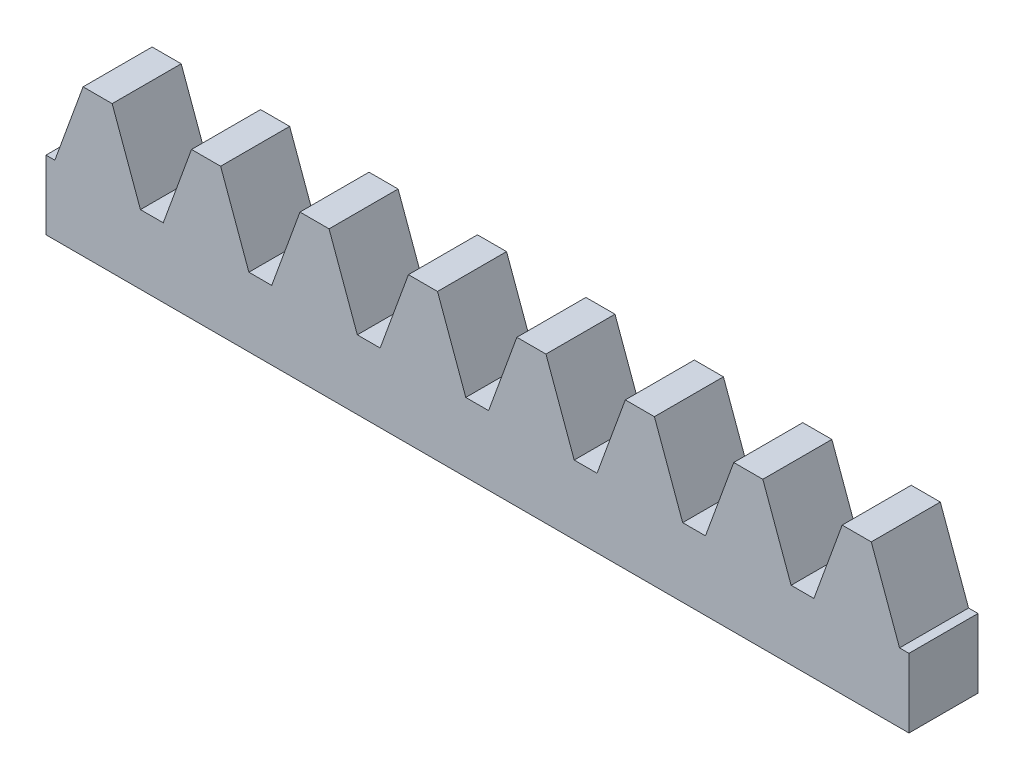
ISO-10303-21;
HEADER;
FILE_DESCRIPTION(('STEP AP214'),'2;1');
FILE_NAME('part.step','',(''),(''),'','','');
FILE_SCHEMA(('AUTOMOTIVE_DESIGN { 1 0 10303 214 1 1 1 1 }'));
ENDSEC;
DATA;
#1=APPLICATION_CONTEXT('core data for automotive mechanical design processes');
#2=APPLICATION_PROTOCOL_DEFINITION('international standard','automotive_design',2000,#1);
#3=PRODUCT_CONTEXT('',#1,'mechanical');
#4=PRODUCT('Part','Part','',(#3));
#5=PRODUCT_RELATED_PRODUCT_CATEGORY('part','',(#4));
#6=PRODUCT_DEFINITION_FORMATION('','',#4);
#7=PRODUCT_DEFINITION_CONTEXT('part definition',#1,'design');
#8=PRODUCT_DEFINITION('design','',#6,#7);
#9=PRODUCT_DEFINITION_SHAPE('','',#8);
#10=(LENGTH_UNIT() NAMED_UNIT(*) SI_UNIT(.MILLI.,.METRE.));
#11=(NAMED_UNIT(*) PLANE_ANGLE_UNIT() SI_UNIT($,.RADIAN.));
#12=(NAMED_UNIT(*) SI_UNIT($,.STERADIAN.) SOLID_ANGLE_UNIT());
#13=UNCERTAINTY_MEASURE_WITH_UNIT(LENGTH_MEASURE(1.E-05),#10,'distance_accuracy_value','');
#14=(GEOMETRIC_REPRESENTATION_CONTEXT(3) GLOBAL_UNCERTAINTY_ASSIGNED_CONTEXT((#13)) GLOBAL_UNIT_ASSIGNED_CONTEXT((#10,
#11,#12)) REPRESENTATION_CONTEXT('',''));
#15=CARTESIAN_POINT('',(0.,0.,0.));
#16=DIRECTION('',(0.,0.,1.));
#17=DIRECTION('',(1.,0.,0.));
#18=AXIS2_PLACEMENT_3D('',#15,#16,#17);
#19=CARTESIAN_POINT('',(0.,0.,50.));
#20=DIRECTION('',(-1.,0.,0.));
#21=DIRECTION('',(0.,0.,1.));
#22=AXIS2_PLACEMENT_3D('',#19,#20,#21);
#23=PLANE('',#22);
#24=DIRECTION('',(0.,-1.,0.));
#25=VECTOR('',#24,1.);
#26=CARTESIAN_POINT('',(0.,100.,-30.));
#27=LINE('',#26,#25);
#28=CARTESIAN_POINT('',(0.,77.5,-30.));
#29=VERTEX_POINT('',#28);
#30=CARTESIAN_POINT('',(0.,57.5,-30.));
#31=VERTEX_POINT('',#30);
#32=EDGE_CURVE('E65',#29,#31,#27,.T.);
#33=ORIENTED_EDGE('',*,*,#32,.F.);
#34=DIRECTION('',(0.,0.,-1.));
#35=VECTOR('',#34,1.);
#36=CARTESIAN_POINT('',(0.,77.5,50.));
#37=LINE('',#36,#35);
#38=CARTESIAN_POINT('',(0.,77.5,-50.));
#39=VERTEX_POINT('',#38);
#40=EDGE_CURVE('E466',#29,#39,#37,.T.);
#41=ORIENTED_EDGE('',*,*,#40,.T.);
#42=DIRECTION('',(0.,1.,0.));
#43=VECTOR('',#42,1.);
#44=CARTESIAN_POINT('',(0.,0.,-50.));
#45=LINE('',#44,#43);
#46=CARTESIAN_POINT('',(0.,57.5,-50.));
#47=VERTEX_POINT('',#46);
#48=EDGE_CURVE('E452',#47,#39,#45,.T.);
#49=ORIENTED_EDGE('',*,*,#48,.F.);
#50=DIRECTION('',(0.,0.,1.));
#51=VECTOR('',#50,1.);
#52=CARTESIAN_POINT('',(0.,57.5,-50.));
#53=LINE('',#52,#51);
#54=EDGE_CURVE('E297',#47,#31,#53,.T.);
#55=ORIENTED_EDGE('',*,*,#54,.T.);
#56=EDGE_LOOP('',(#33,#41,#49,#55));
#57=FACE_BOUND('',#56,.T.);
#58=ADVANCED_FACE('F51',(#57),#23,.T.);
#59=CARTESIAN_POINT('',(230.654977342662,100.,50.));
#60=DIRECTION('',(0.939692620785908,-0.342020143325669,0.));
#61=DIRECTION('',(0.342020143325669,0.939692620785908,0.));
#62=AXIS2_PLACEMENT_3D('',#59,#60,#61);
#63=PLANE('',#62);
#64=DIRECTION('',(0.,0.,-1.));
#65=VECTOR('',#64,1.);
#66=CARTESIAN_POINT('',(222.465647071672,77.5,50.));
#67=LINE('',#66,#65);
#68=CARTESIAN_POINT('',(222.465647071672,77.5,-30.));
#69=VERTEX_POINT('',#68);
#70=CARTESIAN_POINT('',(222.465647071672,77.5,-50.));
#71=VERTEX_POINT('',#70);
#72=EDGE_CURVE('E317',#69,#71,#67,.T.);
#73=ORIENTED_EDGE('',*,*,#72,.F.);
#74=DIRECTION('',(0.342020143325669,0.939692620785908,0.));
#75=VECTOR('',#74,1.);
#76=CARTESIAN_POINT('',(230.654977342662,100.,-30.));
#77=LINE('',#76,#75);
#78=CARTESIAN_POINT('',(230.654977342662,100.,-30.));
#79=VERTEX_POINT('',#78);
#80=EDGE_CURVE('E480',#69,#79,#77,.T.);
#81=ORIENTED_EDGE('',*,*,#80,.T.);
#82=DIRECTION('',(0.,0.,-1.));
#83=VECTOR('',#82,1.);
#84=CARTESIAN_POINT('',(230.654977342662,100.,50.));
#85=LINE('',#84,#83);
#86=CARTESIAN_POINT('',(230.654977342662,100.,-50.));
#87=VERTEX_POINT('',#86);
#88=EDGE_CURVE('E308',#79,#87,#85,.T.);
#89=ORIENTED_EDGE('',*,*,#88,.T.);
#90=DIRECTION('',(-0.342020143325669,-0.939692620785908,0.));
#91=VECTOR('',#90,1.);
#92=CARTESIAN_POINT('',(230.654977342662,100.,-50.));
#93=LINE('',#92,#91);
#94=EDGE_CURVE('E376',#87,#71,#93,.T.);
#95=ORIENTED_EDGE('',*,*,#94,.T.);
#96=EDGE_LOOP('',(#73,#81,#89,#95));
#97=FACE_BOUND('',#96,.T.);
#98=ADVANCED_FACE('F667',(#97),#63,.F.);
#99=CARTESIAN_POINT('',(239.083522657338,100.,50.));
#100=DIRECTION('',(0.,-1.,0.));
#101=DIRECTION('',(0.,0.,-1.));
#102=AXIS2_PLACEMENT_3D('',#99,#100,#101);
#103=PLANE('',#102);
#104=ORIENTED_EDGE('',*,*,#88,.F.);
#105=DIRECTION('',(1.,0.,0.));
#106=VECTOR('',#105,1.);
#107=CARTESIAN_POINT('',(0.,100.,-30.));
#108=LINE('',#107,#106);
#109=CARTESIAN_POINT('',(239.083522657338,100.,-30.));
#110=VERTEX_POINT('',#109);
#111=EDGE_CURVE('E286',#79,#110,#108,.T.);
#112=ORIENTED_EDGE('',*,*,#111,.T.);
#113=DIRECTION('',(0.,0.,-1.));
#114=VECTOR('',#113,1.);
#115=CARTESIAN_POINT('',(239.083522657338,100.,50.));
#116=LINE('',#115,#114);
#117=CARTESIAN_POINT('',(239.083522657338,100.,-50.));
#118=VERTEX_POINT('',#117);
#119=EDGE_CURVE('E309',#110,#118,#116,.T.);
#120=ORIENTED_EDGE('',*,*,#119,.T.);
#121=DIRECTION('',(-1.,0.,0.));
#122=VECTOR('',#121,1.);
#123=CARTESIAN_POINT('',(239.083522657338,100.,-50.));
#124=LINE('',#123,#122);
#125=EDGE_CURVE('E373',#118,#87,#124,.T.);
#126=ORIENTED_EDGE('',*,*,#125,.T.);
#127=EDGE_LOOP('',(#104,#112,#120,#126));
#128=FACE_BOUND('',#127,.T.);
#129=ADVANCED_FACE('F672',(#128),#103,.F.);
#130=CARTESIAN_POINT('',(247.272852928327,77.5,50.));
#131=DIRECTION('',(-0.939692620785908,-0.342020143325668,0.));
#132=DIRECTION('',(0.342020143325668,-0.939692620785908,0.));
#133=AXIS2_PLACEMENT_3D('',#130,#131,#132);
#134=PLANE('',#133);
#135=ORIENTED_EDGE('',*,*,#119,.F.);
#136=DIRECTION('',(0.342020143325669,-0.939692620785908,0.));
#137=VECTOR('',#136,1.);
#138=CARTESIAN_POINT('',(247.272852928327,77.5,-30.));
#139=LINE('',#138,#137);
#140=CARTESIAN_POINT('',(247.272852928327,77.5,-30.));
#141=VERTEX_POINT('',#140);
#142=EDGE_CURVE('E301',#110,#141,#139,.T.);
#143=ORIENTED_EDGE('',*,*,#142,.T.);
#144=DIRECTION('',(0.,0.,-1.));
#145=VECTOR('',#144,1.);
#146=CARTESIAN_POINT('',(247.272852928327,77.5,50.));
#147=LINE('',#146,#145);
#148=CARTESIAN_POINT('',(247.272852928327,77.5,-50.));
#149=VERTEX_POINT('',#148);
#150=EDGE_CURVE('E312',#141,#149,#147,.T.);
#151=ORIENTED_EDGE('',*,*,#150,.T.);
#152=DIRECTION('',(-0.342020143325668,0.939692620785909,0.));
#153=VECTOR('',#152,1.);
#154=CARTESIAN_POINT('',(247.272852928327,77.5,-50.));
#155=LINE('',#154,#153);
#156=EDGE_CURVE('E370',#149,#118,#155,.T.);
#157=ORIENTED_EDGE('',*,*,#156,.T.);
#158=EDGE_LOOP('',(#135,#143,#151,#157));
#159=FACE_BOUND('',#158,.T.);
#160=ADVANCED_FACE('F678',(#159),#134,.F.);
#161=CARTESIAN_POINT('',(250.5772,77.5,50.));
#162=DIRECTION('',(0.,-1.,0.));
#163=DIRECTION('',(0.,0.,-1.));
#164=AXIS2_PLACEMENT_3D('',#161,#162,#163);
#165=PLANE('',#164);
#166=ORIENTED_EDGE('',*,*,#150,.F.);
#167=DIRECTION('',(1.,0.,0.));
#168=VECTOR('',#167,1.);
#169=CARTESIAN_POINT('',(250.5772,77.5,-30.));
#170=LINE('',#169,#168);
#171=CARTESIAN_POINT('',(250.,77.5,-30.));
#172=VERTEX_POINT('',#171);
#173=EDGE_CURVE('E478',#141,#172,#170,.T.);
#174=ORIENTED_EDGE('',*,*,#173,.T.);
#175=DIRECTION('',(0.,0.,-1.));
#176=VECTOR('',#175,1.);
#177=CARTESIAN_POINT('',(250.,77.5,50.));
#178=LINE('',#177,#176);
#179=CARTESIAN_POINT('',(250.,77.5,-50.));
#180=VERTEX_POINT('',#179);
#181=EDGE_CURVE('E290',#172,#180,#178,.T.);
#182=ORIENTED_EDGE('',*,*,#181,.T.);
#183=DIRECTION('',(-1.,0.,0.));
#184=VECTOR('',#183,1.);
#185=CARTESIAN_POINT('',(250.5772,77.5,-50.));
#186=LINE('',#185,#184);
#187=EDGE_CURVE('E307',#180,#149,#186,.T.);
#188=ORIENTED_EDGE('',*,*,#187,.T.);
#189=EDGE_LOOP('',(#166,#174,#182,#188));
#190=FACE_BOUND('',#189,.T.);
#191=ADVANCED_FACE('F706',(#190),#165,.F.);
#192=CARTESIAN_POINT('',(199.239077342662,100.,50.));
#193=DIRECTION('',(0.939692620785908,-0.342020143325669,0.));
#194=DIRECTION('',(0.342020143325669,0.939692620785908,0.));
#195=AXIS2_PLACEMENT_3D('',#192,#193,#194);
#196=PLANE('',#195);
#197=DIRECTION('',(0.,0.,-1.));
#198=VECTOR('',#197,1.);
#199=CARTESIAN_POINT('',(191.049747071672,77.5,50.));
#200=LINE('',#199,#198);
#201=CARTESIAN_POINT('',(191.049747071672,77.5,-30.));
#202=VERTEX_POINT('',#201);
#203=CARTESIAN_POINT('',(191.049747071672,77.5,-50.));
#204=VERTEX_POINT('',#203);
#205=EDGE_CURVE('E325',#202,#204,#200,.T.);
#206=ORIENTED_EDGE('',*,*,#205,.F.);
#207=DIRECTION('',(0.342020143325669,0.939692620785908,0.));
#208=VECTOR('',#207,1.);
#209=CARTESIAN_POINT('',(199.239077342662,100.,-30.));
#210=LINE('',#209,#208);
#211=CARTESIAN_POINT('',(199.239077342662,100.,-30.));
#212=VERTEX_POINT('',#211);
#213=EDGE_CURVE('E489',#202,#212,#210,.T.);
#214=ORIENTED_EDGE('',*,*,#213,.T.);
#215=DIRECTION('',(0.,0.,-1.));
#216=VECTOR('',#215,1.);
#217=CARTESIAN_POINT('',(199.239077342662,100.,50.));
#218=LINE('',#217,#216);
#219=CARTESIAN_POINT('',(199.239077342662,100.,-50.));
#220=VERTEX_POINT('',#219);
#221=EDGE_CURVE('E314',#212,#220,#218,.T.);
#222=ORIENTED_EDGE('',*,*,#221,.T.);
#223=DIRECTION('',(-0.342020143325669,-0.939692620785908,0.));
#224=VECTOR('',#223,1.);
#225=CARTESIAN_POINT('',(199.239077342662,100.,-50.));
#226=LINE('',#225,#224);
#227=EDGE_CURVE('E388',#220,#204,#226,.T.);
#228=ORIENTED_EDGE('',*,*,#227,.T.);
#229=EDGE_LOOP('',(#206,#214,#222,#228));
#230=FACE_BOUND('',#229,.T.);
#231=ADVANCED_FACE('F690',(#230),#196,.F.);
#232=CARTESIAN_POINT('',(207.667622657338,100.,50.));
#233=DIRECTION('',(0.,-1.,0.));
#234=DIRECTION('',(0.,0.,-1.));
#235=AXIS2_PLACEMENT_3D('',#232,#233,#234);
#236=PLANE('',#235);
#237=ORIENTED_EDGE('',*,*,#221,.F.);
#238=CARTESIAN_POINT('',(207.667622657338,100.,-30.));
#239=VERTEX_POINT('',#238);
#240=EDGE_CURVE('E551',#212,#239,#108,.T.);
#241=ORIENTED_EDGE('',*,*,#240,.T.);
#242=DIRECTION('',(0.,0.,-1.));
#243=VECTOR('',#242,1.);
#244=CARTESIAN_POINT('',(207.667622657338,100.,50.));
#245=LINE('',#244,#243);
#246=CARTESIAN_POINT('',(207.667622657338,100.,-50.));
#247=VERTEX_POINT('',#246);
#248=EDGE_CURVE('E315',#239,#247,#245,.T.);
#249=ORIENTED_EDGE('',*,*,#248,.T.);
#250=DIRECTION('',(-1.,0.,0.));
#251=VECTOR('',#250,1.);
#252=CARTESIAN_POINT('',(207.667622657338,100.,-50.));
#253=LINE('',#252,#251);
#254=EDGE_CURVE('E385',#247,#220,#253,.T.);
#255=ORIENTED_EDGE('',*,*,#254,.T.);
#256=EDGE_LOOP('',(#237,#241,#249,#255));
#257=FACE_BOUND('',#256,.T.);
#258=ADVANCED_FACE('F686',(#257),#236,.F.);
#259=CARTESIAN_POINT('',(215.856952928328,77.5,50.));
#260=DIRECTION('',(-0.939692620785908,-0.342020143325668,0.));
#261=DIRECTION('',(0.342020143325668,-0.939692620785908,0.));
#262=AXIS2_PLACEMENT_3D('',#259,#260,#261);
#263=PLANE('',#262);
#264=ORIENTED_EDGE('',*,*,#248,.F.);
#265=DIRECTION('',(0.342020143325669,-0.939692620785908,0.));
#266=VECTOR('',#265,1.);
#267=CARTESIAN_POINT('',(215.856952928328,77.5,-30.));
#268=LINE('',#267,#266);
#269=CARTESIAN_POINT('',(215.856952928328,77.5,-30.));
#270=VERTEX_POINT('',#269);
#271=EDGE_CURVE('E483',#239,#270,#268,.T.);
#272=ORIENTED_EDGE('',*,*,#271,.T.);
#273=DIRECTION('',(0.,0.,-1.));
#274=VECTOR('',#273,1.);
#275=CARTESIAN_POINT('',(215.856952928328,77.5,50.));
#276=LINE('',#275,#274);
#277=CARTESIAN_POINT('',(215.856952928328,77.5,-50.));
#278=VERTEX_POINT('',#277);
#279=EDGE_CURVE('E319',#270,#278,#276,.T.);
#280=ORIENTED_EDGE('',*,*,#279,.T.);
#281=DIRECTION('',(-0.342020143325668,0.939692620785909,0.));
#282=VECTOR('',#281,1.);
#283=CARTESIAN_POINT('',(215.856952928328,77.5,-50.));
#284=LINE('',#283,#282);
#285=EDGE_CURVE('E382',#278,#247,#284,.T.);
#286=ORIENTED_EDGE('',*,*,#285,.T.);
#287=EDGE_LOOP('',(#264,#272,#280,#286));
#288=FACE_BOUND('',#287,.T.);
#289=ADVANCED_FACE('F689',(#288),#263,.F.);
#290=CARTESIAN_POINT('',(219.1613,77.5,50.));
#291=DIRECTION('',(0.,-1.,0.));
#292=DIRECTION('',(0.,0.,-1.));
#293=AXIS2_PLACEMENT_3D('',#290,#291,#292);
#294=PLANE('',#293);
#295=ORIENTED_EDGE('',*,*,#279,.F.);
#296=DIRECTION('',(1.,0.,0.));
#297=VECTOR('',#296,1.);
#298=CARTESIAN_POINT('',(219.1613,77.5,-30.));
#299=LINE('',#298,#297);
#300=EDGE_CURVE('E486',#270,#69,#299,.T.);
#301=ORIENTED_EDGE('',*,*,#300,.T.);
#302=ORIENTED_EDGE('',*,*,#72,.T.);
#303=DIRECTION('',(-1.,0.,0.));
#304=VECTOR('',#303,1.);
#305=CARTESIAN_POINT('',(219.1613,77.5,-50.));
#306=LINE('',#305,#304);
#307=EDGE_CURVE('E379',#71,#278,#306,.T.);
#308=ORIENTED_EDGE('',*,*,#307,.T.);
#309=EDGE_LOOP('',(#295,#301,#302,#308));
#310=FACE_BOUND('',#309,.T.);
#311=ADVANCED_FACE('F696',(#310),#294,.F.);
#312=CARTESIAN_POINT('',(167.823177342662,100.,50.));
#313=DIRECTION('',(0.939692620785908,-0.342020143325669,0.));
#314=DIRECTION('',(0.342020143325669,0.939692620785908,0.));
#315=AXIS2_PLACEMENT_3D('',#312,#313,#314);
#316=PLANE('',#315);
#317=DIRECTION('',(0.,0.,-1.));
#318=VECTOR('',#317,1.);
#319=CARTESIAN_POINT('',(159.633847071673,77.5,50.));
#320=LINE('',#319,#318);
#321=CARTESIAN_POINT('',(159.633847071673,77.5,-30.));
#322=VERTEX_POINT('',#321);
#323=CARTESIAN_POINT('',(159.633847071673,77.5,-50.));
#324=VERTEX_POINT('',#323);
#325=EDGE_CURVE('E330',#322,#324,#320,.T.);
#326=ORIENTED_EDGE('',*,*,#325,.F.);
#327=DIRECTION('',(0.342020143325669,0.939692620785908,0.));
#328=VECTOR('',#327,1.);
#329=CARTESIAN_POINT('',(167.823177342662,100.,-30.));
#330=LINE('',#329,#328);
#331=CARTESIAN_POINT('',(167.823177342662,100.,-30.));
#332=VERTEX_POINT('',#331);
#333=EDGE_CURVE('E498',#322,#332,#330,.T.);
#334=ORIENTED_EDGE('',*,*,#333,.T.);
#335=DIRECTION('',(0.,0.,-1.));
#336=VECTOR('',#335,1.);
#337=CARTESIAN_POINT('',(167.823177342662,100.,50.));
#338=LINE('',#337,#336);
#339=CARTESIAN_POINT('',(167.823177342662,100.,-50.));
#340=VERTEX_POINT('',#339);
#341=EDGE_CURVE('E321',#332,#340,#338,.T.);
#342=ORIENTED_EDGE('',*,*,#341,.T.);
#343=DIRECTION('',(-0.342020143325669,-0.939692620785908,0.));
#344=VECTOR('',#343,1.);
#345=CARTESIAN_POINT('',(167.823177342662,100.,-50.));
#346=LINE('',#345,#344);
#347=EDGE_CURVE('E398',#340,#324,#346,.T.);
#348=ORIENTED_EDGE('',*,*,#347,.T.);
#349=EDGE_LOOP('',(#326,#334,#342,#348));
#350=FACE_BOUND('',#349,.T.);
#351=ADVANCED_FACE('F597',(#350),#316,.F.);
#352=CARTESIAN_POINT('',(176.251722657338,100.,50.));
#353=DIRECTION('',(0.,-1.,0.));
#354=DIRECTION('',(0.,0.,-1.));
#355=AXIS2_PLACEMENT_3D('',#352,#353,#354);
#356=PLANE('',#355);
#357=ORIENTED_EDGE('',*,*,#341,.F.);
#358=CARTESIAN_POINT('',(176.251722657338,100.,-30.));
#359=VERTEX_POINT('',#358);
#360=EDGE_CURVE('E556',#332,#359,#108,.T.);
#361=ORIENTED_EDGE('',*,*,#360,.T.);
#362=DIRECTION('',(0.,0.,-1.));
#363=VECTOR('',#362,1.);
#364=CARTESIAN_POINT('',(176.251722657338,100.,50.));
#365=LINE('',#364,#363);
#366=CARTESIAN_POINT('',(176.251722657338,100.,-50.));
#367=VERTEX_POINT('',#366);
#368=EDGE_CURVE('E323',#359,#367,#365,.T.);
#369=ORIENTED_EDGE('',*,*,#368,.T.);
#370=DIRECTION('',(-1.,0.,0.));
#371=VECTOR('',#370,1.);
#372=CARTESIAN_POINT('',(176.251722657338,100.,-50.));
#373=LINE('',#372,#371);
#374=EDGE_CURVE('E395',#367,#340,#373,.T.);
#375=ORIENTED_EDGE('',*,*,#374,.T.);
#376=EDGE_LOOP('',(#357,#361,#369,#375));
#377=FACE_BOUND('',#376,.T.);
#378=ADVANCED_FACE('F585',(#377),#356,.F.);
#379=CARTESIAN_POINT('',(184.441052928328,77.5,50.));
#380=DIRECTION('',(-0.939692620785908,-0.342020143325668,0.));
#381=DIRECTION('',(0.342020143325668,-0.939692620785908,0.));
#382=AXIS2_PLACEMENT_3D('',#379,#380,#381);
#383=PLANE('',#382);
#384=ORIENTED_EDGE('',*,*,#368,.F.);
#385=DIRECTION('',(0.342020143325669,-0.939692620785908,0.));
#386=VECTOR('',#385,1.);
#387=CARTESIAN_POINT('',(184.441052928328,77.5,-30.));
#388=LINE('',#387,#386);
#389=CARTESIAN_POINT('',(184.441052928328,77.5,-30.));
#390=VERTEX_POINT('',#389);
#391=EDGE_CURVE('E492',#359,#390,#388,.T.);
#392=ORIENTED_EDGE('',*,*,#391,.T.);
#393=DIRECTION('',(0.,0.,-1.));
#394=VECTOR('',#393,1.);
#395=CARTESIAN_POINT('',(184.441052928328,77.5,50.));
#396=LINE('',#395,#394);
#397=CARTESIAN_POINT('',(184.441052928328,77.5,-50.));
#398=VERTEX_POINT('',#397);
#399=EDGE_CURVE('E327',#390,#398,#396,.T.);
#400=ORIENTED_EDGE('',*,*,#399,.T.);
#401=DIRECTION('',(-0.342020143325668,0.939692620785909,0.));
#402=VECTOR('',#401,1.);
#403=CARTESIAN_POINT('',(184.441052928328,77.5,-50.));
#404=LINE('',#403,#402);
#405=EDGE_CURVE('E394',#398,#367,#404,.T.);
#406=ORIENTED_EDGE('',*,*,#405,.T.);
#407=EDGE_LOOP('',(#384,#392,#400,#406));
#408=FACE_BOUND('',#407,.T.);
#409=ADVANCED_FACE('F587',(#408),#383,.F.);
#410=CARTESIAN_POINT('',(187.7454,77.5,50.));
#411=DIRECTION('',(0.,-1.,0.));
#412=DIRECTION('',(0.,0.,-1.));
#413=AXIS2_PLACEMENT_3D('',#410,#411,#412);
#414=PLANE('',#413);
#415=ORIENTED_EDGE('',*,*,#399,.F.);
#416=DIRECTION('',(1.,0.,0.));
#417=VECTOR('',#416,1.);
#418=CARTESIAN_POINT('',(187.7454,77.5,-30.));
#419=LINE('',#418,#417);
#420=EDGE_CURVE('E495',#390,#202,#419,.T.);
#421=ORIENTED_EDGE('',*,*,#420,.T.);
#422=ORIENTED_EDGE('',*,*,#205,.T.);
#423=DIRECTION('',(-1.,0.,0.));
#424=VECTOR('',#423,1.);
#425=CARTESIAN_POINT('',(187.7454,77.5,-50.));
#426=LINE('',#425,#424);
#427=EDGE_CURVE('E391',#204,#398,#426,.T.);
#428=ORIENTED_EDGE('',*,*,#427,.T.);
#429=EDGE_LOOP('',(#415,#421,#422,#428));
#430=FACE_BOUND('',#429,.T.);
#431=ADVANCED_FACE('F734',(#430),#414,.F.);
#432=CARTESIAN_POINT('',(136.407277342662,100.,50.));
#433=DIRECTION('',(0.939692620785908,-0.342020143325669,0.));
#434=DIRECTION('',(0.342020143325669,0.939692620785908,0.));
#435=AXIS2_PLACEMENT_3D('',#432,#433,#434);
#436=PLANE('',#435);
#437=DIRECTION('',(0.,0.,-1.));
#438=VECTOR('',#437,1.);
#439=CARTESIAN_POINT('',(128.217947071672,77.5,50.));
#440=LINE('',#439,#438);
#441=CARTESIAN_POINT('',(128.217947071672,77.5,-30.));
#442=VERTEX_POINT('',#441);
#443=CARTESIAN_POINT('',(128.217947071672,77.5,-50.));
#444=VERTEX_POINT('',#443);
#445=EDGE_CURVE('E338',#442,#444,#440,.T.);
#446=ORIENTED_EDGE('',*,*,#445,.F.);
#447=DIRECTION('',(0.342020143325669,0.939692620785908,0.));
#448=VECTOR('',#447,1.);
#449=CARTESIAN_POINT('',(136.407277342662,100.,-30.));
#450=LINE('',#449,#448);
#451=CARTESIAN_POINT('',(136.407277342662,100.,-30.));
#452=VERTEX_POINT('',#451);
#453=EDGE_CURVE('E507',#442,#452,#450,.T.);
#454=ORIENTED_EDGE('',*,*,#453,.T.);
#455=DIRECTION('',(0.,0.,-1.));
#456=VECTOR('',#455,1.);
#457=CARTESIAN_POINT('',(136.407277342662,100.,50.));
#458=LINE('',#457,#456);
#459=CARTESIAN_POINT('',(136.407277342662,100.,-50.));
#460=VERTEX_POINT('',#459);
#461=EDGE_CURVE('E329',#452,#460,#458,.T.);
#462=ORIENTED_EDGE('',*,*,#461,.T.);
#463=DIRECTION('',(-0.342020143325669,-0.939692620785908,0.));
#464=VECTOR('',#463,1.);
#465=CARTESIAN_POINT('',(136.407277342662,100.,-50.));
#466=LINE('',#465,#464);
#467=EDGE_CURVE('E410',#460,#444,#466,.T.);
#468=ORIENTED_EDGE('',*,*,#467,.T.);
#469=EDGE_LOOP('',(#446,#454,#462,#468));
#470=FACE_BOUND('',#469,.T.);
#471=ADVANCED_FACE('F606',(#470),#436,.F.);
#472=CARTESIAN_POINT('',(144.835822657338,100.,50.));
#473=DIRECTION('',(0.,-1.,0.));
#474=DIRECTION('',(0.,0.,-1.));
#475=AXIS2_PLACEMENT_3D('',#472,#473,#474);
#476=PLANE('',#475);
#477=ORIENTED_EDGE('',*,*,#461,.F.);
#478=CARTESIAN_POINT('',(144.835822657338,100.,-30.));
#479=VERTEX_POINT('',#478);
#480=EDGE_CURVE('E573',#452,#479,#108,.T.);
#481=ORIENTED_EDGE('',*,*,#480,.T.);
#482=DIRECTION('',(0.,0.,-1.));
#483=VECTOR('',#482,1.);
#484=CARTESIAN_POINT('',(144.835822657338,100.,50.));
#485=LINE('',#484,#483);
#486=CARTESIAN_POINT('',(144.835822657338,100.,-50.));
#487=VERTEX_POINT('',#486);
#488=EDGE_CURVE('E332',#479,#487,#485,.T.);
#489=ORIENTED_EDGE('',*,*,#488,.T.);
#490=DIRECTION('',(-1.,0.,0.));
#491=VECTOR('',#490,1.);
#492=CARTESIAN_POINT('',(144.835822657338,100.,-50.));
#493=LINE('',#492,#491);
#494=EDGE_CURVE('E407',#487,#460,#493,.T.);
#495=ORIENTED_EDGE('',*,*,#494,.T.);
#496=EDGE_LOOP('',(#477,#481,#489,#495));
#497=FACE_BOUND('',#496,.T.);
#498=ADVANCED_FACE('F607',(#497),#476,.F.);
#499=CARTESIAN_POINT('',(153.025152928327,77.5,50.));
#500=DIRECTION('',(-0.939692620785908,-0.342020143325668,0.));
#501=DIRECTION('',(0.342020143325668,-0.939692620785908,0.));
#502=AXIS2_PLACEMENT_3D('',#499,#500,#501);
#503=PLANE('',#502);
#504=ORIENTED_EDGE('',*,*,#488,.F.);
#505=DIRECTION('',(0.342020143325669,-0.939692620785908,0.));
#506=VECTOR('',#505,1.);
#507=CARTESIAN_POINT('',(153.025152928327,77.5,-30.));
#508=LINE('',#507,#506);
#509=CARTESIAN_POINT('',(153.025152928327,77.5,-30.));
#510=VERTEX_POINT('',#509);
#511=EDGE_CURVE('E501',#479,#510,#508,.T.);
#512=ORIENTED_EDGE('',*,*,#511,.T.);
#513=DIRECTION('',(0.,0.,-1.));
#514=VECTOR('',#513,1.);
#515=CARTESIAN_POINT('',(153.025152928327,77.5,50.));
#516=LINE('',#515,#514);
#517=CARTESIAN_POINT('',(153.025152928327,77.5,-50.));
#518=VERTEX_POINT('',#517);
#519=EDGE_CURVE('E333',#510,#518,#516,.T.);
#520=ORIENTED_EDGE('',*,*,#519,.T.);
#521=DIRECTION('',(-0.342020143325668,0.939692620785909,0.));
#522=VECTOR('',#521,1.);
#523=CARTESIAN_POINT('',(153.025152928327,77.5,-50.));
#524=LINE('',#523,#522);
#525=EDGE_CURVE('E404',#518,#487,#524,.T.);
#526=ORIENTED_EDGE('',*,*,#525,.T.);
#527=EDGE_LOOP('',(#504,#512,#520,#526));
#528=FACE_BOUND('',#527,.T.);
#529=ADVANCED_FACE('F602',(#528),#503,.F.);
#530=CARTESIAN_POINT('',(156.3295,77.5,50.));
#531=DIRECTION('',(0.,-1.,0.));
#532=DIRECTION('',(0.,0.,-1.));
#533=AXIS2_PLACEMENT_3D('',#530,#531,#532);
#534=PLANE('',#533);
#535=ORIENTED_EDGE('',*,*,#519,.F.);
#536=DIRECTION('',(1.,0.,0.));
#537=VECTOR('',#536,1.);
#538=CARTESIAN_POINT('',(156.3295,77.5,-30.));
#539=LINE('',#538,#537);
#540=EDGE_CURVE('E504',#510,#322,#539,.T.);
#541=ORIENTED_EDGE('',*,*,#540,.T.);
#542=ORIENTED_EDGE('',*,*,#325,.T.);
#543=DIRECTION('',(-1.,0.,0.));
#544=VECTOR('',#543,1.);
#545=CARTESIAN_POINT('',(156.3295,77.5,-50.));
#546=LINE('',#545,#544);
#547=EDGE_CURVE('E401',#324,#518,#546,.T.);
#548=ORIENTED_EDGE('',*,*,#547,.T.);
#549=EDGE_LOOP('',(#535,#541,#542,#548));
#550=FACE_BOUND('',#549,.T.);
#551=ADVANCED_FACE('F600',(#550),#534,.F.);
#552=CARTESIAN_POINT('',(104.991377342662,100.,50.));
#553=DIRECTION('',(0.939692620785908,-0.342020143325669,0.));
#554=DIRECTION('',(0.342020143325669,0.939692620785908,0.));
#555=AXIS2_PLACEMENT_3D('',#552,#553,#554);
#556=PLANE('',#555);
#557=DIRECTION('',(0.,0.,-1.));
#558=VECTOR('',#557,1.);
#559=CARTESIAN_POINT('',(96.8020470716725,77.5,50.));
#560=LINE('',#559,#558);
#561=CARTESIAN_POINT('',(96.8020470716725,77.5,-30.));
#562=VERTEX_POINT('',#561);
#563=CARTESIAN_POINT('',(96.8020470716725,77.5,-50.));
#564=VERTEX_POINT('',#563);
#565=EDGE_CURVE('E345',#562,#564,#560,.T.);
#566=ORIENTED_EDGE('',*,*,#565,.F.);
#567=DIRECTION('',(0.342020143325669,0.939692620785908,0.));
#568=VECTOR('',#567,1.);
#569=CARTESIAN_POINT('',(104.991377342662,100.,-30.));
#570=LINE('',#569,#568);
#571=CARTESIAN_POINT('',(104.991377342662,100.,-30.));
#572=VERTEX_POINT('',#571);
#573=EDGE_CURVE('E516',#562,#572,#570,.T.);
#574=ORIENTED_EDGE('',*,*,#573,.T.);
#575=DIRECTION('',(0.,0.,-1.));
#576=VECTOR('',#575,1.);
#577=CARTESIAN_POINT('',(104.991377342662,100.,50.));
#578=LINE('',#577,#576);
#579=CARTESIAN_POINT('',(104.991377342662,100.,-50.));
#580=VERTEX_POINT('',#579);
#581=EDGE_CURVE('E335',#572,#580,#578,.T.);
#582=ORIENTED_EDGE('',*,*,#581,.T.);
#583=DIRECTION('',(-0.342020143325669,-0.939692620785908,0.));
#584=VECTOR('',#583,1.);
#585=CARTESIAN_POINT('',(104.991377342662,100.,-50.));
#586=LINE('',#585,#584);
#587=EDGE_CURVE('E422',#580,#564,#586,.T.);
#588=ORIENTED_EDGE('',*,*,#587,.T.);
#589=EDGE_LOOP('',(#566,#574,#582,#588));
#590=FACE_BOUND('',#589,.T.);
#591=ADVANCED_FACE('F623',(#590),#556,.F.);
#592=CARTESIAN_POINT('',(113.419922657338,100.,50.));
#593=DIRECTION('',(0.,-1.,0.));
#594=DIRECTION('',(0.,0.,-1.));
#595=AXIS2_PLACEMENT_3D('',#592,#593,#594);
#596=PLANE('',#595);
#597=ORIENTED_EDGE('',*,*,#581,.F.);
#598=CARTESIAN_POINT('',(113.419922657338,100.,-30.));
#599=VERTEX_POINT('',#598);
#600=EDGE_CURVE('E568',#572,#599,#108,.T.);
#601=ORIENTED_EDGE('',*,*,#600,.T.);
#602=DIRECTION('',(0.,0.,-1.));
#603=VECTOR('',#602,1.);
#604=CARTESIAN_POINT('',(113.419922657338,100.,50.));
#605=LINE('',#604,#603);
#606=CARTESIAN_POINT('',(113.419922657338,100.,-50.));
#607=VERTEX_POINT('',#606);
#608=EDGE_CURVE('E336',#599,#607,#605,.T.);
#609=ORIENTED_EDGE('',*,*,#608,.T.);
#610=DIRECTION('',(-1.,0.,0.));
#611=VECTOR('',#610,1.);
#612=CARTESIAN_POINT('',(113.419922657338,100.,-50.));
#613=LINE('',#612,#611);
#614=EDGE_CURVE('E419',#607,#580,#613,.T.);
#615=ORIENTED_EDGE('',*,*,#614,.T.);
#616=EDGE_LOOP('',(#597,#601,#609,#615));
#617=FACE_BOUND('',#616,.T.);
#618=ADVANCED_FACE('F617',(#617),#596,.F.);
#619=CARTESIAN_POINT('',(121.609252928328,77.5,50.));
#620=DIRECTION('',(-0.939692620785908,-0.342020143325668,0.));
#621=DIRECTION('',(0.342020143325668,-0.939692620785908,0.));
#622=AXIS2_PLACEMENT_3D('',#619,#620,#621);
#623=PLANE('',#622);
#624=ORIENTED_EDGE('',*,*,#608,.F.);
#625=DIRECTION('',(0.342020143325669,-0.939692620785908,0.));
#626=VECTOR('',#625,1.);
#627=CARTESIAN_POINT('',(121.609252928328,77.5,-30.));
#628=LINE('',#627,#626);
#629=CARTESIAN_POINT('',(121.609252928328,77.5,-30.));
#630=VERTEX_POINT('',#629);
#631=EDGE_CURVE('E510',#599,#630,#628,.T.);
#632=ORIENTED_EDGE('',*,*,#631,.T.);
#633=DIRECTION('',(0.,0.,-1.));
#634=VECTOR('',#633,1.);
#635=CARTESIAN_POINT('',(121.609252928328,77.5,50.));
#636=LINE('',#635,#634);
#637=CARTESIAN_POINT('',(121.609252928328,77.5,-50.));
#638=VERTEX_POINT('',#637);
#639=EDGE_CURVE('E339',#630,#638,#636,.T.);
#640=ORIENTED_EDGE('',*,*,#639,.T.);
#641=DIRECTION('',(-0.342020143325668,0.939692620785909,0.));
#642=VECTOR('',#641,1.);
#643=CARTESIAN_POINT('',(121.609252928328,77.5,-50.));
#644=LINE('',#643,#642);
#645=EDGE_CURVE('E416',#638,#607,#644,.T.);
#646=ORIENTED_EDGE('',*,*,#645,.T.);
#647=EDGE_LOOP('',(#624,#632,#640,#646));
#648=FACE_BOUND('',#647,.T.);
#649=ADVANCED_FACE('F616',(#648),#623,.F.);
#650=CARTESIAN_POINT('',(124.9136,77.5,50.));
#651=DIRECTION('',(0.,-1.,0.));
#652=DIRECTION('',(0.,0.,-1.));
#653=AXIS2_PLACEMENT_3D('',#650,#651,#652);
#654=PLANE('',#653);
#655=ORIENTED_EDGE('',*,*,#639,.F.);
#656=DIRECTION('',(1.,0.,0.));
#657=VECTOR('',#656,1.);
#658=CARTESIAN_POINT('',(124.9136,77.5,-30.));
#659=LINE('',#658,#657);
#660=EDGE_CURVE('E513',#630,#442,#659,.T.);
#661=ORIENTED_EDGE('',*,*,#660,.T.);
#662=ORIENTED_EDGE('',*,*,#445,.T.);
#663=DIRECTION('',(-1.,0.,0.));
#664=VECTOR('',#663,1.);
#665=CARTESIAN_POINT('',(124.9136,77.5,-50.));
#666=LINE('',#665,#664);
#667=EDGE_CURVE('E413',#444,#638,#666,.T.);
#668=ORIENTED_EDGE('',*,*,#667,.T.);
#669=EDGE_LOOP('',(#655,#661,#662,#668));
#670=FACE_BOUND('',#669,.T.);
#671=ADVANCED_FACE('F614',(#670),#654,.F.);
#672=CARTESIAN_POINT('',(73.5754773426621,100.,50.));
#673=DIRECTION('',(0.939692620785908,-0.342020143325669,0.));
#674=DIRECTION('',(0.342020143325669,0.939692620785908,0.));
#675=AXIS2_PLACEMENT_3D('',#672,#673,#674);
#676=PLANE('',#675);
#677=DIRECTION('',(0.,0.,-1.));
#678=VECTOR('',#677,1.);
#679=CARTESIAN_POINT('',(65.3861470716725,77.5,50.));
#680=LINE('',#679,#678);
#681=CARTESIAN_POINT('',(65.3861470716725,77.5,-30.));
#682=VERTEX_POINT('',#681);
#683=CARTESIAN_POINT('',(65.3861470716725,77.5,-50.));
#684=VERTEX_POINT('',#683);
#685=EDGE_CURVE('E352',#682,#684,#680,.T.);
#686=ORIENTED_EDGE('',*,*,#685,.F.);
#687=DIRECTION('',(0.342020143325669,0.939692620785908,0.));
#688=VECTOR('',#687,1.);
#689=CARTESIAN_POINT('',(73.5754773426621,100.,-30.));
#690=LINE('',#689,#688);
#691=CARTESIAN_POINT('',(73.5754773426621,100.,-30.));
#692=VERTEX_POINT('',#691);
#693=EDGE_CURVE('E525',#682,#692,#690,.T.);
#694=ORIENTED_EDGE('',*,*,#693,.T.);
#695=DIRECTION('',(0.,0.,-1.));
#696=VECTOR('',#695,1.);
#697=CARTESIAN_POINT('',(73.5754773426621,100.,50.));
#698=LINE('',#697,#696);
#699=CARTESIAN_POINT('',(73.5754773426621,100.,-50.));
#700=VERTEX_POINT('',#699);
#701=EDGE_CURVE('E341',#692,#700,#698,.T.);
#702=ORIENTED_EDGE('',*,*,#701,.T.);
#703=DIRECTION('',(-0.342020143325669,-0.939692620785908,0.));
#704=VECTOR('',#703,1.);
#705=CARTESIAN_POINT('',(73.5754773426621,100.,-50.));
#706=LINE('',#705,#704);
#707=EDGE_CURVE('E434',#700,#684,#706,.T.);
#708=ORIENTED_EDGE('',*,*,#707,.T.);
#709=EDGE_LOOP('',(#686,#694,#702,#708));
#710=FACE_BOUND('',#709,.T.);
#711=ADVANCED_FACE('F632',(#710),#676,.F.);
#712=CARTESIAN_POINT('',(82.004022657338,100.,50.));
#713=DIRECTION('',(0.,-1.,0.));
#714=DIRECTION('',(0.,0.,-1.));
#715=AXIS2_PLACEMENT_3D('',#712,#713,#714);
#716=PLANE('',#715);
#717=ORIENTED_EDGE('',*,*,#701,.F.);
#718=CARTESIAN_POINT('',(82.0040226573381,100.,-30.));
#719=VERTEX_POINT('',#718);
#720=EDGE_CURVE('E563',#692,#719,#108,.T.);
#721=ORIENTED_EDGE('',*,*,#720,.T.);
#722=DIRECTION('',(0.,0.,-1.));
#723=VECTOR('',#722,1.);
#724=CARTESIAN_POINT('',(82.004022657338,100.,50.));
#725=LINE('',#724,#723);
#726=CARTESIAN_POINT('',(82.004022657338,100.,-50.));
#727=VERTEX_POINT('',#726);
#728=EDGE_CURVE('E343',#719,#727,#725,.T.);
#729=ORIENTED_EDGE('',*,*,#728,.T.);
#730=DIRECTION('',(-1.,0.,0.));
#731=VECTOR('',#730,1.);
#732=CARTESIAN_POINT('',(82.004022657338,100.,-50.));
#733=LINE('',#732,#731);
#734=EDGE_CURVE('E431',#727,#700,#733,.T.);
#735=ORIENTED_EDGE('',*,*,#734,.T.);
#736=EDGE_LOOP('',(#717,#721,#729,#735));
#737=FACE_BOUND('',#736,.T.);
#738=ADVANCED_FACE('F633',(#737),#716,.F.);
#739=CARTESIAN_POINT('',(90.1933529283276,77.5,50.));
#740=DIRECTION('',(-0.939692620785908,-0.342020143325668,0.));
#741=DIRECTION('',(0.342020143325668,-0.939692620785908,0.));
#742=AXIS2_PLACEMENT_3D('',#739,#740,#741);
#743=PLANE('',#742);
#744=ORIENTED_EDGE('',*,*,#728,.F.);
#745=DIRECTION('',(0.342020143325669,-0.939692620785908,0.));
#746=VECTOR('',#745,1.);
#747=CARTESIAN_POINT('',(90.1933529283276,77.5,-30.));
#748=LINE('',#747,#746);
#749=CARTESIAN_POINT('',(90.1933529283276,77.5,-30.));
#750=VERTEX_POINT('',#749);
#751=EDGE_CURVE('E519',#719,#750,#748,.T.);
#752=ORIENTED_EDGE('',*,*,#751,.T.);
#753=DIRECTION('',(0.,0.,-1.));
#754=VECTOR('',#753,1.);
#755=CARTESIAN_POINT('',(90.1933529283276,77.5,50.));
#756=LINE('',#755,#754);
#757=CARTESIAN_POINT('',(90.1933529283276,77.5,-50.));
#758=VERTEX_POINT('',#757);
#759=EDGE_CURVE('E347',#750,#758,#756,.T.);
#760=ORIENTED_EDGE('',*,*,#759,.T.);
#761=DIRECTION('',(-0.342020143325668,0.939692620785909,0.));
#762=VECTOR('',#761,1.);
#763=CARTESIAN_POINT('',(90.1933529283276,77.5,-50.));
#764=LINE('',#763,#762);
#765=EDGE_CURVE('E428',#758,#727,#764,.T.);
#766=ORIENTED_EDGE('',*,*,#765,.T.);
#767=EDGE_LOOP('',(#744,#752,#760,#766));
#768=FACE_BOUND('',#767,.T.);
#769=ADVANCED_FACE('F628',(#768),#743,.F.);
#770=CARTESIAN_POINT('',(93.4977,77.5,50.));
#771=DIRECTION('',(0.,-1.,0.));
#772=DIRECTION('',(0.,0.,-1.));
#773=AXIS2_PLACEMENT_3D('',#770,#771,#772);
#774=PLANE('',#773);
#775=ORIENTED_EDGE('',*,*,#759,.F.);
#776=DIRECTION('',(1.,0.,0.));
#777=VECTOR('',#776,1.);
#778=CARTESIAN_POINT('',(93.4977,77.5,-30.));
#779=LINE('',#778,#777);
#780=EDGE_CURVE('E522',#750,#562,#779,.T.);
#781=ORIENTED_EDGE('',*,*,#780,.T.);
#782=ORIENTED_EDGE('',*,*,#565,.T.);
#783=DIRECTION('',(-1.,0.,0.));
#784=VECTOR('',#783,1.);
#785=CARTESIAN_POINT('',(93.4977,77.5,-50.));
#786=LINE('',#785,#784);
#787=EDGE_CURVE('E425',#564,#758,#786,.T.);
#788=ORIENTED_EDGE('',*,*,#787,.T.);
#789=EDGE_LOOP('',(#775,#781,#782,#788));
#790=FACE_BOUND('',#789,.T.);
#791=ADVANCED_FACE('F626',(#790),#774,.F.);
#792=CARTESIAN_POINT('',(42.159577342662,100.,50.));
#793=DIRECTION('',(0.939692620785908,-0.342020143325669,0.));
#794=DIRECTION('',(0.342020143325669,0.939692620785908,0.));
#795=AXIS2_PLACEMENT_3D('',#792,#793,#794);
#796=PLANE('',#795);
#797=DIRECTION('',(0.,0.,-1.));
#798=VECTOR('',#797,1.);
#799=CARTESIAN_POINT('',(33.9702470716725,77.5,50.));
#800=LINE('',#799,#798);
#801=CARTESIAN_POINT('',(33.9702470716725,77.5,-30.));
#802=VERTEX_POINT('',#801);
#803=CARTESIAN_POINT('',(33.9702470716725,77.5,-50.));
#804=VERTEX_POINT('',#803);
#805=EDGE_CURVE('E358',#802,#804,#800,.T.);
#806=ORIENTED_EDGE('',*,*,#805,.F.);
#807=DIRECTION('',(0.342020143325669,0.939692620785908,0.));
#808=VECTOR('',#807,1.);
#809=CARTESIAN_POINT('',(42.159577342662,100.,-30.));
#810=LINE('',#809,#808);
#811=CARTESIAN_POINT('',(42.159577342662,100.,-30.));
#812=VERTEX_POINT('',#811);
#813=EDGE_CURVE('E534',#802,#812,#810,.T.);
#814=ORIENTED_EDGE('',*,*,#813,.T.);
#815=DIRECTION('',(0.,0.,-1.));
#816=VECTOR('',#815,1.);
#817=CARTESIAN_POINT('',(42.159577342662,100.,50.));
#818=LINE('',#817,#816);
#819=CARTESIAN_POINT('',(42.159577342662,100.,-50.));
#820=VERTEX_POINT('',#819);
#821=EDGE_CURVE('E349',#812,#820,#818,.T.);
#822=ORIENTED_EDGE('',*,*,#821,.T.);
#823=DIRECTION('',(-0.342020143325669,-0.939692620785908,0.));
#824=VECTOR('',#823,1.);
#825=CARTESIAN_POINT('',(42.159577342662,100.,-50.));
#826=LINE('',#825,#824);
#827=EDGE_CURVE('E449',#820,#804,#826,.T.);
#828=ORIENTED_EDGE('',*,*,#827,.T.);
#829=EDGE_LOOP('',(#806,#814,#822,#828));
#830=FACE_BOUND('',#829,.T.);
#831=ADVANCED_FACE('F649',(#830),#796,.F.);
#832=CARTESIAN_POINT('',(50.588122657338,100.,50.));
#833=DIRECTION('',(0.,-1.,0.));
#834=DIRECTION('',(0.,0.,-1.));
#835=AXIS2_PLACEMENT_3D('',#832,#833,#834);
#836=PLANE('',#835);
#837=ORIENTED_EDGE('',*,*,#821,.F.);
#838=CARTESIAN_POINT('',(50.5881226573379,100.,-30.));
#839=VERTEX_POINT('',#838);
#840=EDGE_CURVE('E558',#812,#839,#108,.T.);
#841=ORIENTED_EDGE('',*,*,#840,.T.);
#842=DIRECTION('',(0.,0.,-1.));
#843=VECTOR('',#842,1.);
#844=CARTESIAN_POINT('',(50.588122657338,100.,50.));
#845=LINE('',#844,#843);
#846=CARTESIAN_POINT('',(50.588122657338,100.,-50.));
#847=VERTEX_POINT('',#846);
#848=EDGE_CURVE('E350',#839,#847,#845,.T.);
#849=ORIENTED_EDGE('',*,*,#848,.T.);
#850=DIRECTION('',(-1.,0.,0.));
#851=VECTOR('',#850,1.);
#852=CARTESIAN_POINT('',(50.588122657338,100.,-50.));
#853=LINE('',#852,#851);
#854=EDGE_CURVE('E446',#847,#820,#853,.T.);
#855=ORIENTED_EDGE('',*,*,#854,.T.);
#856=EDGE_LOOP('',(#837,#841,#849,#855));
#857=FACE_BOUND('',#856,.T.);
#858=ADVANCED_FACE('F643',(#857),#836,.F.);
#859=CARTESIAN_POINT('',(58.7774529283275,77.5,50.));
#860=DIRECTION('',(-0.939692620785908,-0.342020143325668,0.));
#861=DIRECTION('',(0.342020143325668,-0.939692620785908,0.));
#862=AXIS2_PLACEMENT_3D('',#859,#860,#861);
#863=PLANE('',#862);
#864=ORIENTED_EDGE('',*,*,#848,.F.);
#865=DIRECTION('',(0.342020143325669,-0.939692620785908,0.));
#866=VECTOR('',#865,1.);
#867=CARTESIAN_POINT('',(58.7774529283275,77.5,-30.));
#868=LINE('',#867,#866);
#869=CARTESIAN_POINT('',(58.7774529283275,77.5,-30.));
#870=VERTEX_POINT('',#869);
#871=EDGE_CURVE('E528',#839,#870,#868,.T.);
#872=ORIENTED_EDGE('',*,*,#871,.T.);
#873=DIRECTION('',(0.,0.,-1.));
#874=VECTOR('',#873,1.);
#875=CARTESIAN_POINT('',(58.7774529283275,77.5,50.));
#876=LINE('',#875,#874);
#877=CARTESIAN_POINT('',(58.7774529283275,77.5,-50.));
#878=VERTEX_POINT('',#877);
#879=EDGE_CURVE('E355',#870,#878,#876,.T.);
#880=ORIENTED_EDGE('',*,*,#879,.T.);
#881=DIRECTION('',(-0.342020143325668,0.939692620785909,0.));
#882=VECTOR('',#881,1.);
#883=CARTESIAN_POINT('',(58.7774529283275,77.5,-50.));
#884=LINE('',#883,#882);
#885=EDGE_CURVE('E440',#878,#847,#884,.T.);
#886=ORIENTED_EDGE('',*,*,#885,.T.);
#887=EDGE_LOOP('',(#864,#872,#880,#886));
#888=FACE_BOUND('',#887,.T.);
#889=ADVANCED_FACE('F642',(#888),#863,.F.);
#890=CARTESIAN_POINT('',(62.0818,77.5,50.));
#891=DIRECTION('',(0.,-1.,0.));
#892=DIRECTION('',(0.,0.,-1.));
#893=AXIS2_PLACEMENT_3D('',#890,#891,#892);
#894=PLANE('',#893);
#895=ORIENTED_EDGE('',*,*,#879,.F.);
#896=DIRECTION('',(1.,0.,0.));
#897=VECTOR('',#896,1.);
#898=CARTESIAN_POINT('',(62.0818,77.5,-30.));
#899=LINE('',#898,#897);
#900=EDGE_CURVE('E531',#870,#682,#899,.T.);
#901=ORIENTED_EDGE('',*,*,#900,.T.);
#902=ORIENTED_EDGE('',*,*,#685,.T.);
#903=DIRECTION('',(-1.,0.,0.));
#904=VECTOR('',#903,1.);
#905=CARTESIAN_POINT('',(62.0818,77.5,-50.));
#906=LINE('',#905,#904);
#907=EDGE_CURVE('E437',#684,#878,#906,.T.);
#908=ORIENTED_EDGE('',*,*,#907,.T.);
#909=EDGE_LOOP('',(#895,#901,#902,#908));
#910=FACE_BOUND('',#909,.T.);
#911=ADVANCED_FACE('F640',(#910),#894,.F.);
#912=CARTESIAN_POINT('',(10.743677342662,100.,50.));
#913=DIRECTION('',(0.939692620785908,-0.342020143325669,0.));
#914=DIRECTION('',(0.342020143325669,0.939692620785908,0.));
#915=AXIS2_PLACEMENT_3D('',#912,#913,#914);
#916=PLANE('',#915);
#917=DIRECTION('',(0.,0.,-1.));
#918=VECTOR('',#917,1.);
#919=CARTESIAN_POINT('',(2.55434707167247,77.5,50.));
#920=LINE('',#919,#918);
#921=CARTESIAN_POINT('',(2.55434707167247,77.5,-30.));
#922=VERTEX_POINT('',#921);
#923=CARTESIAN_POINT('',(2.55434707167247,77.5,-50.));
#924=VERTEX_POINT('',#923);
#925=EDGE_CURVE('E464',#922,#924,#920,.T.);
#926=ORIENTED_EDGE('',*,*,#925,.F.);
#927=DIRECTION('',(0.342020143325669,0.939692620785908,0.));
#928=VECTOR('',#927,1.);
#929=CARTESIAN_POINT('',(10.743677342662,100.,-30.));
#930=LINE('',#929,#928);
#931=CARTESIAN_POINT('',(10.743677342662,100.,-30.));
#932=VERTEX_POINT('',#931);
#933=EDGE_CURVE('E543',#922,#932,#930,.T.);
#934=ORIENTED_EDGE('',*,*,#933,.T.);
#935=DIRECTION('',(0.,0.,-1.));
#936=VECTOR('',#935,1.);
#937=CARTESIAN_POINT('',(10.743677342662,100.,50.));
#938=LINE('',#937,#936);
#939=CARTESIAN_POINT('',(10.743677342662,100.,-50.));
#940=VERTEX_POINT('',#939);
#941=EDGE_CURVE('E353',#932,#940,#938,.T.);
#942=ORIENTED_EDGE('',*,*,#941,.T.);
#943=DIRECTION('',(-0.342020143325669,-0.939692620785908,0.));
#944=VECTOR('',#943,1.);
#945=CARTESIAN_POINT('',(10.743677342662,100.,-50.));
#946=LINE('',#945,#944);
#947=EDGE_CURVE('E445',#940,#924,#946,.T.);
#948=ORIENTED_EDGE('',*,*,#947,.T.);
#949=EDGE_LOOP('',(#926,#934,#942,#948));
#950=FACE_BOUND('',#949,.T.);
#951=ADVANCED_FACE('F658',(#950),#916,.F.);
#952=CARTESIAN_POINT('',(19.172222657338,100.,50.));
#953=DIRECTION('',(0.,-1.,0.));
#954=DIRECTION('',(0.,0.,-1.));
#955=AXIS2_PLACEMENT_3D('',#952,#953,#954);
#956=PLANE('',#955);
#957=ORIENTED_EDGE('',*,*,#941,.F.);
#958=CARTESIAN_POINT('',(19.172222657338,100.,-30.));
#959=VERTEX_POINT('',#958);
#960=EDGE_CURVE('E548',#932,#959,#108,.T.);
#961=ORIENTED_EDGE('',*,*,#960,.T.);
#962=DIRECTION('',(0.,0.,-1.));
#963=VECTOR('',#962,1.);
#964=CARTESIAN_POINT('',(19.172222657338,100.,50.));
#965=LINE('',#964,#963);
#966=CARTESIAN_POINT('',(19.172222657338,100.,-50.));
#967=VERTEX_POINT('',#966);
#968=EDGE_CURVE('E356',#959,#967,#965,.T.);
#969=ORIENTED_EDGE('',*,*,#968,.T.);
#970=DIRECTION('',(-1.,0.,0.));
#971=VECTOR('',#970,1.);
#972=CARTESIAN_POINT('',(19.172222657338,100.,-50.));
#973=LINE('',#972,#971);
#974=EDGE_CURVE('E441',#967,#940,#973,.T.);
#975=ORIENTED_EDGE('',*,*,#974,.T.);
#976=EDGE_LOOP('',(#957,#961,#969,#975));
#977=FACE_BOUND('',#976,.T.);
#978=ADVANCED_FACE('F659',(#977),#956,.F.);
#979=CARTESIAN_POINT('',(27.3615529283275,77.5,50.));
#980=DIRECTION('',(-0.939692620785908,-0.342020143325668,0.));
#981=DIRECTION('',(0.342020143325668,-0.939692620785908,0.));
#982=AXIS2_PLACEMENT_3D('',#979,#980,#981);
#983=PLANE('',#982);
#984=ORIENTED_EDGE('',*,*,#968,.F.);
#985=DIRECTION('',(0.342020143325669,-0.939692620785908,0.));
#986=VECTOR('',#985,1.);
#987=CARTESIAN_POINT('',(27.3615529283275,77.5,-30.));
#988=LINE('',#987,#986);
#989=CARTESIAN_POINT('',(27.3615529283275,77.5,-30.));
#990=VERTEX_POINT('',#989);
#991=EDGE_CURVE('E537',#959,#990,#988,.T.);
#992=ORIENTED_EDGE('',*,*,#991,.T.);
#993=DIRECTION('',(0.,0.,-1.));
#994=VECTOR('',#993,1.);
#995=CARTESIAN_POINT('',(27.3615529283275,77.5,50.));
#996=LINE('',#995,#994);
#997=CARTESIAN_POINT('',(27.3615529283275,77.5,-50.));
#998=VERTEX_POINT('',#997);
#999=EDGE_CURVE('E360',#990,#998,#996,.T.);
#1000=ORIENTED_EDGE('',*,*,#999,.T.);
#1001=DIRECTION('',(-0.342020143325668,0.939692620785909,0.));
#1002=VECTOR('',#1001,1.);
#1003=CARTESIAN_POINT('',(27.3615529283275,77.5,-50.));
#1004=LINE('',#1003,#1002);
#1005=EDGE_CURVE('E444',#998,#967,#1004,.T.);
#1006=ORIENTED_EDGE('',*,*,#1005,.T.);
#1007=EDGE_LOOP('',(#984,#992,#1000,#1006));
#1008=FACE_BOUND('',#1007,.T.);
#1009=ADVANCED_FACE('F654',(#1008),#983,.F.);
#1010=CARTESIAN_POINT('',(30.6659,77.5,50.));
#1011=DIRECTION('',(0.,-1.,0.));
#1012=DIRECTION('',(0.,0.,-1.));
#1013=AXIS2_PLACEMENT_3D('',#1010,#1011,#1012);
#1014=PLANE('',#1013);
#1015=ORIENTED_EDGE('',*,*,#999,.F.);
#1016=DIRECTION('',(1.,0.,0.));
#1017=VECTOR('',#1016,1.);
#1018=CARTESIAN_POINT('',(30.6659,77.5,-30.));
#1019=LINE('',#1018,#1017);
#1020=EDGE_CURVE('E540',#990,#802,#1019,.T.);
#1021=ORIENTED_EDGE('',*,*,#1020,.T.);
#1022=ORIENTED_EDGE('',*,*,#805,.T.);
#1023=DIRECTION('',(-1.,0.,0.));
#1024=VECTOR('',#1023,1.);
#1025=CARTESIAN_POINT('',(30.6659,77.5,-50.));
#1026=LINE('',#1025,#1024);
#1027=EDGE_CURVE('E455',#804,#998,#1026,.T.);
#1028=ORIENTED_EDGE('',*,*,#1027,.T.);
#1029=EDGE_LOOP('',(#1015,#1021,#1022,#1028));
#1030=FACE_BOUND('',#1029,.T.);
#1031=ADVANCED_FACE('F652',(#1030),#1014,.F.);
#1032=CARTESIAN_POINT('',(0.,0.,-50.));
#1033=DIRECTION('',(0.,0.,1.));
#1034=DIRECTION('',(1.,0.,0.));
#1035=AXIS2_PLACEMENT_3D('',#1032,#1033,#1034);
#1036=PLANE('',#1035);
#1037=DIRECTION('',(0.,-1.,0.));
#1038=VECTOR('',#1037,1.);
#1039=CARTESIAN_POINT('',(250.,0.,-50.));
#1040=LINE('',#1039,#1038);
#1041=CARTESIAN_POINT('',(250.,57.5,-50.));
#1042=VERTEX_POINT('',#1041);
#1043=EDGE_CURVE('E58',#180,#1042,#1040,.T.);
#1044=ORIENTED_EDGE('',*,*,#1043,.T.);
#1045=DIRECTION('',(-1.,0.,0.));
#1046=VECTOR('',#1045,1.);
#1047=CARTESIAN_POINT('',(0.,57.5,-50.));
#1048=LINE('',#1047,#1046);
#1049=EDGE_CURVE('E295',#1042,#47,#1048,.T.);
#1050=ORIENTED_EDGE('',*,*,#1049,.T.);
#1051=ORIENTED_EDGE('',*,*,#48,.T.);
#1052=DIRECTION('',(-1.,0.,0.));
#1053=VECTOR('',#1052,1.);
#1054=CARTESIAN_POINT('',(2.55434707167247,77.5,-50.));
#1055=LINE('',#1054,#1053);
#1056=EDGE_CURVE('E457',#924,#39,#1055,.T.);
#1057=ORIENTED_EDGE('',*,*,#1056,.F.);
#1058=ORIENTED_EDGE('',*,*,#947,.F.);
#1059=ORIENTED_EDGE('',*,*,#974,.F.);
#1060=ORIENTED_EDGE('',*,*,#1005,.F.);
#1061=ORIENTED_EDGE('',*,*,#1027,.F.);
#1062=ORIENTED_EDGE('',*,*,#827,.F.);
#1063=ORIENTED_EDGE('',*,*,#854,.F.);
#1064=ORIENTED_EDGE('',*,*,#885,.F.);
#1065=ORIENTED_EDGE('',*,*,#907,.F.);
#1066=ORIENTED_EDGE('',*,*,#707,.F.);
#1067=ORIENTED_EDGE('',*,*,#734,.F.);
#1068=ORIENTED_EDGE('',*,*,#765,.F.);
#1069=ORIENTED_EDGE('',*,*,#787,.F.);
#1070=ORIENTED_EDGE('',*,*,#587,.F.);
#1071=ORIENTED_EDGE('',*,*,#614,.F.);
#1072=ORIENTED_EDGE('',*,*,#645,.F.);
#1073=ORIENTED_EDGE('',*,*,#667,.F.);
#1074=ORIENTED_EDGE('',*,*,#467,.F.);
#1075=ORIENTED_EDGE('',*,*,#494,.F.);
#1076=ORIENTED_EDGE('',*,*,#525,.F.);
#1077=ORIENTED_EDGE('',*,*,#547,.F.);
#1078=ORIENTED_EDGE('',*,*,#347,.F.);
#1079=ORIENTED_EDGE('',*,*,#374,.F.);
#1080=ORIENTED_EDGE('',*,*,#405,.F.);
#1081=ORIENTED_EDGE('',*,*,#427,.F.);
#1082=ORIENTED_EDGE('',*,*,#227,.F.);
#1083=ORIENTED_EDGE('',*,*,#254,.F.);
#1084=ORIENTED_EDGE('',*,*,#285,.F.);
#1085=ORIENTED_EDGE('',*,*,#307,.F.);
#1086=ORIENTED_EDGE('',*,*,#94,.F.);
#1087=ORIENTED_EDGE('',*,*,#125,.F.);
#1088=ORIENTED_EDGE('',*,*,#156,.F.);
#1089=ORIENTED_EDGE('',*,*,#187,.F.);
#1090=EDGE_LOOP('',(#1044,#1050,#1051,#1057,#1058,#1059,#1060,#1061,#1062,#1063,#1064,#1065,
#1066,#1067,#1068,#1069,#1070,#1071,#1072,#1073,#1074,#1075,#1076,#1077,#1078,#1079,#1080,#1081,
#1082,#1083,#1084,#1085,#1086,#1087,#1088,#1089));
#1091=FACE_BOUND('',#1090,.T.);
#1092=ADVANCED_FACE('F304',(#1091),#1036,.F.);
#1093=CARTESIAN_POINT('',(2.55434707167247,77.5,50.));
#1094=DIRECTION('',(0.,-1.,0.));
#1095=DIRECTION('',(0.,0.,-1.));
#1096=AXIS2_PLACEMENT_3D('',#1093,#1094,#1095);
#1097=PLANE('',#1096);
#1098=ORIENTED_EDGE('',*,*,#40,.F.);
#1099=DIRECTION('',(1.,0.,0.));
#1100=VECTOR('',#1099,1.);
#1101=CARTESIAN_POINT('',(2.55434707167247,77.5,-30.));
#1102=LINE('',#1101,#1100);
#1103=EDGE_CURVE('E291',#29,#922,#1102,.T.);
#1104=ORIENTED_EDGE('',*,*,#1103,.T.);
#1105=ORIENTED_EDGE('',*,*,#925,.T.);
#1106=ORIENTED_EDGE('',*,*,#1056,.T.);
#1107=EDGE_LOOP('',(#1098,#1104,#1105,#1106));
#1108=FACE_BOUND('',#1107,.T.);
#1109=ADVANCED_FACE('F664',(#1108),#1097,.F.);
#1110=CARTESIAN_POINT('',(250.,0.,-83.6275765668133));
#1111=DIRECTION('',(-1.,0.,0.));
#1112=DIRECTION('',(0.,0.,1.));
#1113=AXIS2_PLACEMENT_3D('',#1110,#1111,#1112);
#1114=PLANE('',#1113);
#1115=ORIENTED_EDGE('',*,*,#181,.F.);
#1116=DIRECTION('',(0.,-1.,0.));
#1117=VECTOR('',#1116,1.);
#1118=CARTESIAN_POINT('',(250.,100.,-30.));
#1119=LINE('',#1118,#1117);
#1120=CARTESIAN_POINT('',(250.,57.5,-30.));
#1121=VERTEX_POINT('',#1120);
#1122=EDGE_CURVE('E282',#172,#1121,#1119,.T.);
#1123=ORIENTED_EDGE('',*,*,#1122,.T.);
#1124=DIRECTION('',(0.,0.,-1.));
#1125=VECTOR('',#1124,1.);
#1126=CARTESIAN_POINT('',(250.,57.5,-83.6275765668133));
#1127=LINE('',#1126,#1125);
#1128=EDGE_CURVE('E11',#1121,#1042,#1127,.T.);
#1129=ORIENTED_EDGE('',*,*,#1128,.T.);
#1130=ORIENTED_EDGE('',*,*,#1043,.F.);
#1131=EDGE_LOOP('',(#1115,#1123,#1129,#1130));
#1132=FACE_BOUND('',#1131,.T.);
#1133=ADVANCED_FACE('F289',(#1132),#1114,.F.);
#1134=CARTESIAN_POINT('',(0.,57.5,-50.));
#1135=DIRECTION('',(0.,1.,0.));
#1136=DIRECTION('',(0.,0.,1.));
#1137=AXIS2_PLACEMENT_3D('',#1134,#1135,#1136);
#1138=PLANE('',#1137);
#1139=ORIENTED_EDGE('',*,*,#1128,.F.);
#1140=DIRECTION('',(1.,0.,0.));
#1141=VECTOR('',#1140,1.);
#1142=CARTESIAN_POINT('',(0.,57.5,-30.));
#1143=LINE('',#1142,#1141);
#1144=EDGE_CURVE('E280',#31,#1121,#1143,.T.);
#1145=ORIENTED_EDGE('',*,*,#1144,.F.);
#1146=ORIENTED_EDGE('',*,*,#54,.F.);
#1147=ORIENTED_EDGE('',*,*,#1049,.F.);
#1148=EDGE_LOOP('',(#1139,#1145,#1146,#1147));
#1149=FACE_BOUND('',#1148,.T.);
#1150=ADVANCED_FACE('F293',(#1149),#1138,.F.);
#1151=CARTESIAN_POINT('',(0.,100.,-30.));
#1152=DIRECTION('',(0.,0.,-1.));
#1153=DIRECTION('',(-1.,0.,0.));
#1154=AXIS2_PLACEMENT_3D('',#1151,#1152,#1153);
#1155=PLANE('',#1154);
#1156=ORIENTED_EDGE('',*,*,#111,.F.);
#1157=ORIENTED_EDGE('',*,*,#80,.F.);
#1158=ORIENTED_EDGE('',*,*,#300,.F.);
#1159=ORIENTED_EDGE('',*,*,#271,.F.);
#1160=ORIENTED_EDGE('',*,*,#240,.F.);
#1161=ORIENTED_EDGE('',*,*,#213,.F.);
#1162=ORIENTED_EDGE('',*,*,#420,.F.);
#1163=ORIENTED_EDGE('',*,*,#391,.F.);
#1164=ORIENTED_EDGE('',*,*,#360,.F.);
#1165=ORIENTED_EDGE('',*,*,#333,.F.);
#1166=ORIENTED_EDGE('',*,*,#540,.F.);
#1167=ORIENTED_EDGE('',*,*,#511,.F.);
#1168=ORIENTED_EDGE('',*,*,#480,.F.);
#1169=ORIENTED_EDGE('',*,*,#453,.F.);
#1170=ORIENTED_EDGE('',*,*,#660,.F.);
#1171=ORIENTED_EDGE('',*,*,#631,.F.);
#1172=ORIENTED_EDGE('',*,*,#600,.F.);
#1173=ORIENTED_EDGE('',*,*,#573,.F.);
#1174=ORIENTED_EDGE('',*,*,#780,.F.);
#1175=ORIENTED_EDGE('',*,*,#751,.F.);
#1176=ORIENTED_EDGE('',*,*,#720,.F.);
#1177=ORIENTED_EDGE('',*,*,#693,.F.);
#1178=ORIENTED_EDGE('',*,*,#900,.F.);
#1179=ORIENTED_EDGE('',*,*,#871,.F.);
#1180=ORIENTED_EDGE('',*,*,#840,.F.);
#1181=ORIENTED_EDGE('',*,*,#813,.F.);
#1182=ORIENTED_EDGE('',*,*,#1020,.F.);
#1183=ORIENTED_EDGE('',*,*,#991,.F.);
#1184=ORIENTED_EDGE('',*,*,#960,.F.);
#1185=ORIENTED_EDGE('',*,*,#933,.F.);
#1186=ORIENTED_EDGE('',*,*,#1103,.F.);
#1187=ORIENTED_EDGE('',*,*,#32,.T.);
#1188=ORIENTED_EDGE('',*,*,#1144,.T.);
#1189=ORIENTED_EDGE('',*,*,#1122,.F.);
#1190=ORIENTED_EDGE('',*,*,#173,.F.);
#1191=ORIENTED_EDGE('',*,*,#142,.F.);
#1192=EDGE_LOOP('',(#1156,#1157,#1158,#1159,#1160,#1161,#1162,#1163,#1164,#1165,#1166,#1167,
#1168,#1169,#1170,#1171,#1172,#1173,#1174,#1175,#1176,#1177,#1178,#1179,#1180,#1181,#1182,#1183,
#1184,#1185,#1186,#1187,#1188,#1189,#1190,#1191));
#1193=FACE_BOUND('',#1192,.T.);
#1194=ADVANCED_FACE('F281',(#1193),#1155,.F.);
#1195=CLOSED_SHELL('',(#58,#98,#129,#160,#191,#231,#258,#289,#311,#351,#378,#409,#431,#471,#498,
#529,#551,#591,#618,#649,#671,#711,#738,#769,#791,#831,#858,#889,#911,#951,#978,#1009,#1031,
#1092,#1109,#1133,#1150,#1194));
#1196=MANIFOLD_SOLID_BREP('B2',#1195);
#1197=ADVANCED_BREP_SHAPE_REPRESENTATION('',(#18,#1196),#14);
#1198=SHAPE_DEFINITION_REPRESENTATION(#9,#1197);
ENDSEC;
END-ISO-10303-21;
